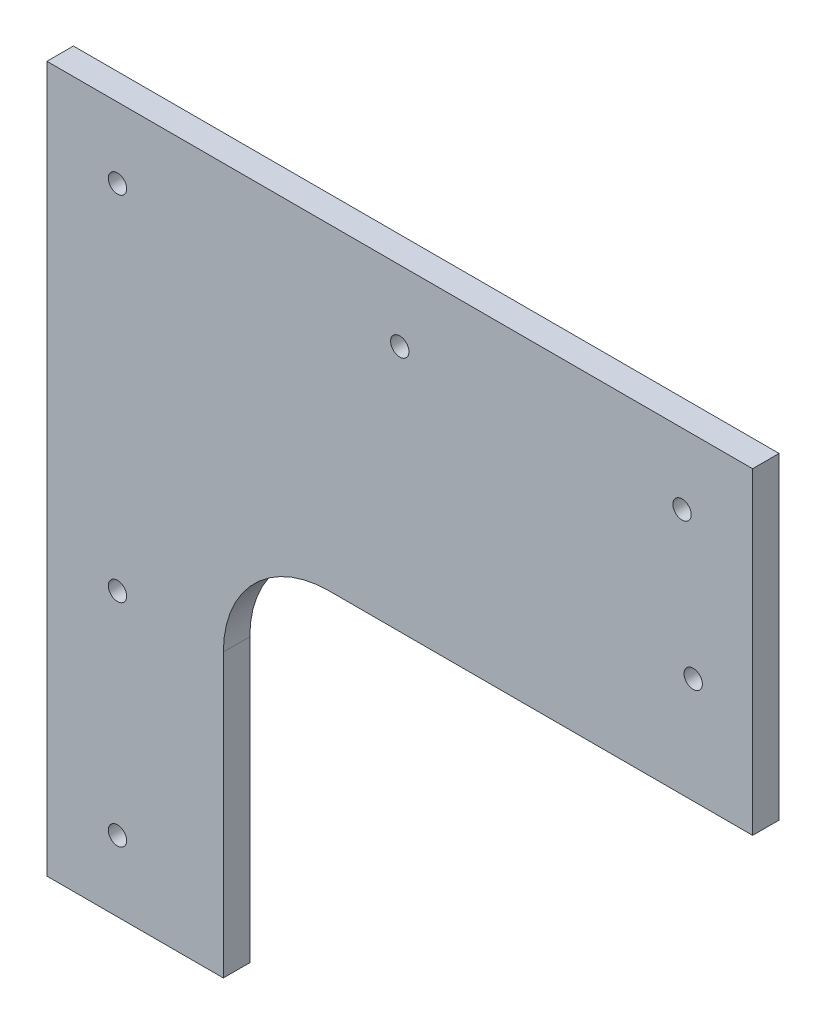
ISO-10303-21;
HEADER;
FILE_DESCRIPTION(('STEP AP214'),'2;1');
FILE_NAME('part.step','',(''),(''),'','','');
FILE_SCHEMA(('AUTOMOTIVE_DESIGN { 1 0 10303 214 1 1 1 1 }'));
ENDSEC;
DATA;
#1=APPLICATION_CONTEXT('core data for automotive mechanical design processes');
#2=APPLICATION_PROTOCOL_DEFINITION('international standard','automotive_design',2000,#1);
#3=PRODUCT_CONTEXT('',#1,'mechanical');
#4=PRODUCT('Part','Part','',(#3));
#5=PRODUCT_RELATED_PRODUCT_CATEGORY('part','',(#4));
#6=PRODUCT_DEFINITION_FORMATION('','',#4);
#7=PRODUCT_DEFINITION_CONTEXT('part definition',#1,'design');
#8=PRODUCT_DEFINITION('design','',#6,#7);
#9=PRODUCT_DEFINITION_SHAPE('','',#8);
#10=(LENGTH_UNIT() NAMED_UNIT(*) SI_UNIT(.MILLI.,.METRE.));
#11=(NAMED_UNIT(*) PLANE_ANGLE_UNIT() SI_UNIT($,.RADIAN.));
#12=(NAMED_UNIT(*) SI_UNIT($,.STERADIAN.) SOLID_ANGLE_UNIT());
#13=UNCERTAINTY_MEASURE_WITH_UNIT(LENGTH_MEASURE(1.E-05),#10,'distance_accuracy_value','');
#14=(GEOMETRIC_REPRESENTATION_CONTEXT(3) GLOBAL_UNCERTAINTY_ASSIGNED_CONTEXT((#13)) GLOBAL_UNIT_ASSIGNED_CONTEXT((#10,
#11,#12)) REPRESENTATION_CONTEXT('',''));
#15=CARTESIAN_POINT('',(0.,0.,0.));
#16=DIRECTION('',(0.,0.,1.));
#17=DIRECTION('',(1.,0.,0.));
#18=AXIS2_PLACEMENT_3D('',#15,#16,#17);
#19=CARTESIAN_POINT('',(0.,-254.,9.525));
#20=DIRECTION('',(1.,0.,0.));
#21=DIRECTION('',(0.,0.,-1.));
#22=AXIS2_PLACEMENT_3D('',#19,#20,#21);
#23=PLANE('',#22);
#24=DIRECTION('',(0.,-1.,0.));
#25=VECTOR('',#24,1.);
#26=CARTESIAN_POINT('',(0.,-254.,0.));
#27=LINE('',#26,#25);
#28=CARTESIAN_POINT('',(0.,0.,0.));
#29=VERTEX_POINT('',#28);
#30=CARTESIAN_POINT('',(0.,-254.,0.));
#31=VERTEX_POINT('',#30);
#32=EDGE_CURVE('E111',#29,#31,#27,.T.);
#33=ORIENTED_EDGE('',*,*,#32,.T.);
#34=DIRECTION('',(0.,0.,-1.));
#35=VECTOR('',#34,1.);
#36=CARTESIAN_POINT('',(0.,-254.,9.525));
#37=LINE('',#36,#35);
#38=CARTESIAN_POINT('',(0.,-254.,9.525));
#39=VERTEX_POINT('',#38);
#40=EDGE_CURVE('E93',#39,#31,#37,.T.);
#41=ORIENTED_EDGE('',*,*,#40,.F.);
#42=DIRECTION('',(0.,-1.,0.));
#43=VECTOR('',#42,1.);
#44=CARTESIAN_POINT('',(0.,-254.,9.525));
#45=LINE('',#44,#43);
#46=CARTESIAN_POINT('',(0.,0.,9.525));
#47=VERTEX_POINT('',#46);
#48=EDGE_CURVE('E99',#47,#39,#45,.T.);
#49=ORIENTED_EDGE('',*,*,#48,.F.);
#50=DIRECTION('',(0.,0.,-1.));
#51=VECTOR('',#50,1.);
#52=CARTESIAN_POINT('',(0.,0.,9.525));
#53=LINE('',#52,#51);
#54=EDGE_CURVE('E125',#47,#29,#53,.T.);
#55=ORIENTED_EDGE('',*,*,#54,.T.);
#56=EDGE_LOOP('',(#33,#41,#49,#55));
#57=FACE_BOUND('',#56,.T.);
#58=ADVANCED_FACE('F30',(#57),#23,.F.);
#59=CARTESIAN_POINT('',(63.5,-254.,9.525));
#60=DIRECTION('',(0.,1.,0.));
#61=DIRECTION('',(0.,0.,1.));
#62=AXIS2_PLACEMENT_3D('',#59,#60,#61);
#63=PLANE('',#62);
#64=DIRECTION('',(1.,0.,0.));
#65=VECTOR('',#64,1.);
#66=CARTESIAN_POINT('',(63.5,-254.,0.));
#67=LINE('',#66,#65);
#68=CARTESIAN_POINT('',(63.5,-254.,0.));
#69=VERTEX_POINT('',#68);
#70=EDGE_CURVE('E134',#31,#69,#67,.T.);
#71=ORIENTED_EDGE('',*,*,#70,.T.);
#72=DIRECTION('',(0.,0.,-1.));
#73=VECTOR('',#72,1.);
#74=CARTESIAN_POINT('',(63.5,-254.,9.525));
#75=LINE('',#74,#73);
#76=CARTESIAN_POINT('',(63.5,-254.,9.525));
#77=VERTEX_POINT('',#76);
#78=EDGE_CURVE('E96',#77,#69,#75,.T.);
#79=ORIENTED_EDGE('',*,*,#78,.F.);
#80=DIRECTION('',(1.,0.,0.));
#81=VECTOR('',#80,1.);
#82=CARTESIAN_POINT('',(63.5,-254.,9.525));
#83=LINE('',#82,#81);
#84=EDGE_CURVE('E89',#39,#77,#83,.T.);
#85=ORIENTED_EDGE('',*,*,#84,.F.);
#86=ORIENTED_EDGE('',*,*,#40,.T.);
#87=EDGE_LOOP('',(#71,#79,#85,#86));
#88=FACE_BOUND('',#87,.T.);
#89=ADVANCED_FACE('F91',(#88),#63,.F.);
#90=CARTESIAN_POINT('',(63.5,-114.3,9.525));
#91=DIRECTION('',(-1.,0.,0.));
#92=DIRECTION('',(0.,0.,1.));
#93=AXIS2_PLACEMENT_3D('',#90,#91,#92);
#94=PLANE('',#93);
#95=DIRECTION('',(0.,1.,0.));
#96=VECTOR('',#95,1.);
#97=CARTESIAN_POINT('',(63.5,-114.3,0.));
#98=LINE('',#97,#96);
#99=CARTESIAN_POINT('',(63.5,-152.4,0.));
#100=VERTEX_POINT('',#99);
#101=EDGE_CURVE('E132',#69,#100,#98,.T.);
#102=ORIENTED_EDGE('',*,*,#101,.T.);
#103=DIRECTION('',(0.,0.,-1.));
#104=VECTOR('',#103,1.);
#105=CARTESIAN_POINT('',(63.5,-152.4,9.525));
#106=LINE('',#105,#104);
#107=CARTESIAN_POINT('',(63.5,-152.4,9.525));
#108=VERTEX_POINT('',#107);
#109=EDGE_CURVE('E45',#100,#108,#106,.F.);
#110=ORIENTED_EDGE('',*,*,#109,.T.);
#111=DIRECTION('',(0.,1.,0.));
#112=VECTOR('',#111,1.);
#113=CARTESIAN_POINT('',(63.5,-114.3,9.525));
#114=LINE('',#113,#112);
#115=EDGE_CURVE('E98',#77,#108,#114,.T.);
#116=ORIENTED_EDGE('',*,*,#115,.F.);
#117=ORIENTED_EDGE('',*,*,#78,.T.);
#118=EDGE_LOOP('',(#102,#110,#116,#117));
#119=FACE_BOUND('',#118,.T.);
#120=ADVANCED_FACE('F222',(#119),#94,.F.);
#121=CARTESIAN_POINT('',(254.,-114.3,9.525));
#122=DIRECTION('',(0.,1.,0.));
#123=DIRECTION('',(-1.,0.,0.));
#124=AXIS2_PLACEMENT_3D('',#121,#122,#123);
#125=PLANE('',#124);
#126=DIRECTION('',(1.,0.,0.));
#127=VECTOR('',#126,1.);
#128=CARTESIAN_POINT('',(254.,-114.3,9.525));
#129=LINE('',#128,#127);
#130=CARTESIAN_POINT('',(101.6,-114.3,9.525));
#131=VERTEX_POINT('',#130);
#132=CARTESIAN_POINT('',(254.,-114.3,9.525));
#133=VERTEX_POINT('',#132);
#134=EDGE_CURVE('E141',#131,#133,#129,.T.);
#135=ORIENTED_EDGE('',*,*,#134,.F.);
#136=DIRECTION('',(0.,0.,-1.));
#137=VECTOR('',#136,1.);
#138=CARTESIAN_POINT('',(101.6,-114.3,0.));
#139=LINE('',#138,#137);
#140=CARTESIAN_POINT('',(101.6,-114.3,0.));
#141=VERTEX_POINT('',#140);
#142=EDGE_CURVE('E112',#131,#141,#139,.T.);
#143=ORIENTED_EDGE('',*,*,#142,.T.);
#144=DIRECTION('',(1.,0.,0.));
#145=VECTOR('',#144,1.);
#146=CARTESIAN_POINT('',(254.,-114.3,0.));
#147=LINE('',#146,#145);
#148=CARTESIAN_POINT('',(254.,-114.3,0.));
#149=VERTEX_POINT('',#148);
#150=EDGE_CURVE('E130',#141,#149,#147,.T.);
#151=ORIENTED_EDGE('',*,*,#150,.T.);
#152=DIRECTION('',(0.,0.,-1.));
#153=VECTOR('',#152,1.);
#154=CARTESIAN_POINT('',(254.,-114.3,9.525));
#155=LINE('',#154,#153);
#156=EDGE_CURVE('E116',#133,#149,#155,.T.);
#157=ORIENTED_EDGE('',*,*,#156,.F.);
#158=EDGE_LOOP('',(#135,#143,#151,#157));
#159=FACE_BOUND('',#158,.T.);
#160=ADVANCED_FACE('F227',(#159),#125,.F.);
#161=CARTESIAN_POINT('',(254.,0.,9.525));
#162=DIRECTION('',(-1.,0.,0.));
#163=DIRECTION('',(0.,0.,1.));
#164=AXIS2_PLACEMENT_3D('',#161,#162,#163);
#165=PLANE('',#164);
#166=DIRECTION('',(0.,1.,0.));
#167=VECTOR('',#166,1.);
#168=CARTESIAN_POINT('',(254.,0.,0.));
#169=LINE('',#168,#167);
#170=CARTESIAN_POINT('',(254.,0.,0.));
#171=VERTEX_POINT('',#170);
#172=EDGE_CURVE('E128',#149,#171,#169,.T.);
#173=ORIENTED_EDGE('',*,*,#172,.T.);
#174=DIRECTION('',(0.,0.,-1.));
#175=VECTOR('',#174,1.);
#176=CARTESIAN_POINT('',(254.,0.,9.525));
#177=LINE('',#176,#175);
#178=CARTESIAN_POINT('',(254.,0.,9.525));
#179=VERTEX_POINT('',#178);
#180=EDGE_CURVE('E122',#179,#171,#177,.T.);
#181=ORIENTED_EDGE('',*,*,#180,.F.);
#182=DIRECTION('',(0.,1.,0.));
#183=VECTOR('',#182,1.);
#184=CARTESIAN_POINT('',(254.,0.,9.525));
#185=LINE('',#184,#183);
#186=EDGE_CURVE('E139',#133,#179,#185,.T.);
#187=ORIENTED_EDGE('',*,*,#186,.F.);
#188=ORIENTED_EDGE('',*,*,#156,.T.);
#189=EDGE_LOOP('',(#173,#181,#187,#188));
#190=FACE_BOUND('',#189,.T.);
#191=ADVANCED_FACE('F230',(#190),#165,.F.);
#192=CARTESIAN_POINT('',(0.,0.,9.525));
#193=DIRECTION('',(0.,-1.,0.));
#194=DIRECTION('',(0.,0.,-1.));
#195=AXIS2_PLACEMENT_3D('',#192,#193,#194);
#196=PLANE('',#195);
#197=DIRECTION('',(-1.,0.,0.));
#198=VECTOR('',#197,1.);
#199=CARTESIAN_POINT('',(0.,0.,0.));
#200=LINE('',#199,#198);
#201=EDGE_CURVE('E108',#171,#29,#200,.T.);
#202=ORIENTED_EDGE('',*,*,#201,.T.);
#203=ORIENTED_EDGE('',*,*,#54,.F.);
#204=DIRECTION('',(-1.,0.,0.));
#205=VECTOR('',#204,1.);
#206=CARTESIAN_POINT('',(0.,0.,9.525));
#207=LINE('',#206,#205);
#208=EDGE_CURVE('E104',#179,#47,#207,.T.);
#209=ORIENTED_EDGE('',*,*,#208,.F.);
#210=ORIENTED_EDGE('',*,*,#180,.T.);
#211=EDGE_LOOP('',(#202,#203,#209,#210));
#212=FACE_BOUND('',#211,.T.);
#213=ADVANCED_FACE('F192',(#212),#196,.F.);
#214=CARTESIAN_POINT('',(0.,0.,9.525));
#215=DIRECTION('',(0.,0.,-1.));
#216=DIRECTION('',(-1.,0.,0.));
#217=AXIS2_PLACEMENT_3D('',#214,#215,#216);
#218=PLANE('',#217);
#219=CARTESIAN_POINT('',(232.613237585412,-76.2,9.525));
#220=DIRECTION('',(0.,0.,1.));
#221=DIRECTION('',(1.,0.,0.));
#222=AXIS2_PLACEMENT_3D('',#219,#220,#221);
#223=CIRCLE('',#222,3.30200000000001);
#224=CARTESIAN_POINT('',(235.915237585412,-76.2,9.525));
#225=VERTEX_POINT('',#224);
#226=EDGE_CURVE('E174',#225,#225,#223,.T.);
#227=ORIENTED_EDGE('',*,*,#226,.F.);
#228=EDGE_LOOP('',(#227));
#229=FACE_BOUND('',#228,.T.);
#230=CARTESIAN_POINT('',(228.6,-25.4,9.525));
#231=DIRECTION('',(0.,0.,1.));
#232=DIRECTION('',(1.,0.,0.));
#233=AXIS2_PLACEMENT_3D('',#230,#231,#232);
#234=CIRCLE('',#233,3.30200000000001);
#235=CARTESIAN_POINT('',(231.902,-25.4,9.525));
#236=VERTEX_POINT('',#235);
#237=EDGE_CURVE('E168',#236,#236,#234,.T.);
#238=ORIENTED_EDGE('',*,*,#237,.F.);
#239=EDGE_LOOP('',(#238));
#240=FACE_BOUND('',#239,.T.);
#241=CARTESIAN_POINT('',(127.,-25.4,9.525));
#242=DIRECTION('',(0.,0.,1.));
#243=DIRECTION('',(1.,0.,0.));
#244=AXIS2_PLACEMENT_3D('',#241,#242,#243);
#245=CIRCLE('',#244,3.30200000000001);
#246=CARTESIAN_POINT('',(130.302,-25.4,9.525));
#247=VERTEX_POINT('',#246);
#248=EDGE_CURVE('E162',#247,#247,#245,.T.);
#249=ORIENTED_EDGE('',*,*,#248,.F.);
#250=EDGE_LOOP('',(#249));
#251=FACE_BOUND('',#250,.T.);
#252=CARTESIAN_POINT('',(25.4,-25.4,9.525));
#253=DIRECTION('',(0.,0.,1.));
#254=DIRECTION('',(1.,0.,0.));
#255=AXIS2_PLACEMENT_3D('',#252,#253,#254);
#256=CIRCLE('',#255,3.302);
#257=CARTESIAN_POINT('',(28.702,-25.4,9.525));
#258=VERTEX_POINT('',#257);
#259=EDGE_CURVE('E156',#258,#258,#256,.T.);
#260=ORIENTED_EDGE('',*,*,#259,.F.);
#261=EDGE_LOOP('',(#260));
#262=FACE_BOUND('',#261,.T.);
#263=CARTESIAN_POINT('',(25.4,-152.4,9.525));
#264=DIRECTION('',(0.,0.,1.));
#265=DIRECTION('',(1.,0.,0.));
#266=AXIS2_PLACEMENT_3D('',#263,#264,#265);
#267=CIRCLE('',#266,3.30199999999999);
#268=CARTESIAN_POINT('',(28.702,-152.4,9.525));
#269=VERTEX_POINT('',#268);
#270=EDGE_CURVE('E150',#269,#269,#267,.T.);
#271=ORIENTED_EDGE('',*,*,#270,.F.);
#272=EDGE_LOOP('',(#271));
#273=FACE_BOUND('',#272,.T.);
#274=CARTESIAN_POINT('',(25.4,-228.6,9.525));
#275=DIRECTION('',(0.,0.,1.));
#276=DIRECTION('',(1.,0.,0.));
#277=AXIS2_PLACEMENT_3D('',#274,#275,#276);
#278=CIRCLE('',#277,3.30199999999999);
#279=CARTESIAN_POINT('',(28.702,-228.6,9.525));
#280=VERTEX_POINT('',#279);
#281=EDGE_CURVE('E144',#280,#280,#278,.T.);
#282=ORIENTED_EDGE('',*,*,#281,.F.);
#283=EDGE_LOOP('',(#282));
#284=FACE_BOUND('',#283,.T.);
#285=ORIENTED_EDGE('',*,*,#48,.T.);
#286=ORIENTED_EDGE('',*,*,#84,.T.);
#287=ORIENTED_EDGE('',*,*,#115,.T.);
#288=CARTESIAN_POINT('',(101.6,-152.4,9.525));
#289=DIRECTION('',(0.,0.,-1.));
#290=DIRECTION('',(-1.,0.,0.));
#291=AXIS2_PLACEMENT_3D('',#288,#289,#290);
#292=CIRCLE('',#291,38.1);
#293=EDGE_CURVE('E11',#108,#131,#292,.T.);
#294=ORIENTED_EDGE('',*,*,#293,.T.);
#295=ORIENTED_EDGE('',*,*,#134,.T.);
#296=ORIENTED_EDGE('',*,*,#186,.T.);
#297=ORIENTED_EDGE('',*,*,#208,.T.);
#298=EDGE_LOOP('',(#285,#286,#287,#294,#295,#296,#297));
#299=FACE_BOUND('',#298,.T.);
#300=ADVANCED_FACE('F102',(#229,#240,#251,#262,#273,#284,#299),#218,.F.);
#301=CARTESIAN_POINT('',(0.,0.,0.));
#302=DIRECTION('',(0.,0.,-1.));
#303=DIRECTION('',(-1.,0.,0.));
#304=AXIS2_PLACEMENT_3D('',#301,#302,#303);
#305=PLANE('',#304);
#306=CARTESIAN_POINT('',(232.613237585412,-76.2,0.));
#307=DIRECTION('',(0.,0.,1.));
#308=DIRECTION('',(1.,0.,0.));
#309=AXIS2_PLACEMENT_3D('',#306,#307,#308);
#310=CIRCLE('',#309,3.30200000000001);
#311=CARTESIAN_POINT('',(235.915237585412,-76.2,0.));
#312=VERTEX_POINT('',#311);
#313=EDGE_CURVE('E171',#312,#312,#310,.T.);
#314=ORIENTED_EDGE('',*,*,#313,.T.);
#315=EDGE_LOOP('',(#314));
#316=FACE_BOUND('',#315,.T.);
#317=CARTESIAN_POINT('',(228.6,-25.4,0.));
#318=DIRECTION('',(0.,0.,1.));
#319=DIRECTION('',(1.,0.,0.));
#320=AXIS2_PLACEMENT_3D('',#317,#318,#319);
#321=CIRCLE('',#320,3.30200000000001);
#322=CARTESIAN_POINT('',(231.902,-25.4,0.));
#323=VERTEX_POINT('',#322);
#324=EDGE_CURVE('E165',#323,#323,#321,.T.);
#325=ORIENTED_EDGE('',*,*,#324,.T.);
#326=EDGE_LOOP('',(#325));
#327=FACE_BOUND('',#326,.T.);
#328=CARTESIAN_POINT('',(127.,-25.4,0.));
#329=DIRECTION('',(0.,0.,1.));
#330=DIRECTION('',(1.,0.,0.));
#331=AXIS2_PLACEMENT_3D('',#328,#329,#330);
#332=CIRCLE('',#331,3.30200000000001);
#333=CARTESIAN_POINT('',(130.302,-25.4,0.));
#334=VERTEX_POINT('',#333);
#335=EDGE_CURVE('E159',#334,#334,#332,.T.);
#336=ORIENTED_EDGE('',*,*,#335,.T.);
#337=EDGE_LOOP('',(#336));
#338=FACE_BOUND('',#337,.T.);
#339=CARTESIAN_POINT('',(25.4,-25.4,0.));
#340=DIRECTION('',(0.,0.,1.));
#341=DIRECTION('',(1.,0.,0.));
#342=AXIS2_PLACEMENT_3D('',#339,#340,#341);
#343=CIRCLE('',#342,3.302);
#344=CARTESIAN_POINT('',(28.702,-25.4,0.));
#345=VERTEX_POINT('',#344);
#346=EDGE_CURVE('E153',#345,#345,#343,.T.);
#347=ORIENTED_EDGE('',*,*,#346,.T.);
#348=EDGE_LOOP('',(#347));
#349=FACE_BOUND('',#348,.T.);
#350=CARTESIAN_POINT('',(25.4,-152.4,0.));
#351=DIRECTION('',(0.,0.,1.));
#352=DIRECTION('',(1.,0.,0.));
#353=AXIS2_PLACEMENT_3D('',#350,#351,#352);
#354=CIRCLE('',#353,3.30199999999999);
#355=CARTESIAN_POINT('',(28.702,-152.4,0.));
#356=VERTEX_POINT('',#355);
#357=EDGE_CURVE('E147',#356,#356,#354,.T.);
#358=ORIENTED_EDGE('',*,*,#357,.T.);
#359=EDGE_LOOP('',(#358));
#360=FACE_BOUND('',#359,.T.);
#361=CARTESIAN_POINT('',(25.4,-228.6,0.));
#362=DIRECTION('',(0.,0.,1.));
#363=DIRECTION('',(1.,0.,0.));
#364=AXIS2_PLACEMENT_3D('',#361,#362,#363);
#365=CIRCLE('',#364,3.30199999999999);
#366=CARTESIAN_POINT('',(28.702,-228.6,0.));
#367=VERTEX_POINT('',#366);
#368=EDGE_CURVE('E137',#367,#367,#365,.T.);
#369=ORIENTED_EDGE('',*,*,#368,.T.);
#370=EDGE_LOOP('',(#369));
#371=FACE_BOUND('',#370,.T.);
#372=ORIENTED_EDGE('',*,*,#32,.F.);
#373=ORIENTED_EDGE('',*,*,#201,.F.);
#374=ORIENTED_EDGE('',*,*,#172,.F.);
#375=ORIENTED_EDGE('',*,*,#150,.F.);
#376=CARTESIAN_POINT('',(101.6,-152.4,0.));
#377=DIRECTION('',(0.,0.,-1.));
#378=DIRECTION('',(-1.,0.,0.));
#379=AXIS2_PLACEMENT_3D('',#376,#377,#378);
#380=CIRCLE('',#379,38.1);
#381=EDGE_CURVE('E38',#141,#100,#380,.F.);
#382=ORIENTED_EDGE('',*,*,#381,.T.);
#383=ORIENTED_EDGE('',*,*,#101,.F.);
#384=ORIENTED_EDGE('',*,*,#70,.F.);
#385=EDGE_LOOP('',(#372,#373,#374,#375,#382,#383,#384));
#386=FACE_BOUND('',#385,.T.);
#387=ADVANCED_FACE('F180',(#316,#327,#338,#349,#360,#371,#386),#305,.T.);
#388=CARTESIAN_POINT('',(101.6,-152.4,9.525));
#389=DIRECTION('',(0.,0.,1.));
#390=DIRECTION('',(1.,0.,0.));
#391=AXIS2_PLACEMENT_3D('',#388,#389,#390);
#392=CYLINDRICAL_SURFACE('',#391,38.1);
#393=ORIENTED_EDGE('',*,*,#293,.F.);
#394=ORIENTED_EDGE('',*,*,#109,.F.);
#395=ORIENTED_EDGE('',*,*,#381,.F.);
#396=ORIENTED_EDGE('',*,*,#142,.F.);
#397=EDGE_LOOP('',(#393,#394,#395,#396));
#398=FACE_BOUND('',#397,.T.);
#399=ADVANCED_FACE('F32',(#398),#392,.F.);
#400=CARTESIAN_POINT('',(25.4,-228.6,0.));
#401=DIRECTION('',(0.,0.,1.));
#402=DIRECTION('',(1.,0.,0.));
#403=AXIS2_PLACEMENT_3D('',#400,#401,#402);
#404=CYLINDRICAL_SURFACE('',#403,3.30199999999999);
#405=CARTESIAN_POINT('',(28.702,-228.6,0.));
#406=CARTESIAN_POINT('',(28.702,-228.6,0.0992187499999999));
#407=CARTESIAN_POINT('',(28.702,-228.6,0.1984375));
#408=CARTESIAN_POINT('',(28.702,-228.6,0.396875));
#409=CARTESIAN_POINT('',(28.702,-228.6,0.49609375));
#410=CARTESIAN_POINT('',(28.702,-228.6,0.69453125));
#411=CARTESIAN_POINT('',(28.702,-228.6,0.79375));
#412=CARTESIAN_POINT('',(28.702,-228.6,0.9921875));
#413=CARTESIAN_POINT('',(28.702,-228.6,1.09140625));
#414=CARTESIAN_POINT('',(28.702,-228.6,1.28984375));
#415=CARTESIAN_POINT('',(28.702,-228.6,1.3890625));
#416=CARTESIAN_POINT('',(28.702,-228.6,1.5875));
#417=CARTESIAN_POINT('',(28.702,-228.6,1.68671875));
#418=CARTESIAN_POINT('',(28.702,-228.6,1.88515625));
#419=CARTESIAN_POINT('',(28.702,-228.6,1.984375));
#420=CARTESIAN_POINT('',(28.702,-228.6,2.1828125));
#421=CARTESIAN_POINT('',(28.702,-228.6,2.28203125));
#422=CARTESIAN_POINT('',(28.702,-228.6,2.48046875));
#423=CARTESIAN_POINT('',(28.702,-228.6,2.5796875));
#424=CARTESIAN_POINT('',(28.702,-228.6,2.778125));
#425=CARTESIAN_POINT('',(28.702,-228.6,2.87734375));
#426=CARTESIAN_POINT('',(28.702,-228.6,3.07578125));
#427=CARTESIAN_POINT('',(28.702,-228.6,3.175));
#428=CARTESIAN_POINT('',(28.702,-228.6,3.3734375));
#429=CARTESIAN_POINT('',(28.702,-228.6,3.47265625));
#430=CARTESIAN_POINT('',(28.702,-228.6,3.67109375));
#431=CARTESIAN_POINT('',(28.702,-228.6,3.7703125));
#432=CARTESIAN_POINT('',(28.702,-228.6,3.96875));
#433=CARTESIAN_POINT('',(28.702,-228.6,4.06796875));
#434=CARTESIAN_POINT('',(28.702,-228.6,4.26640625));
#435=CARTESIAN_POINT('',(28.702,-228.6,4.365625));
#436=CARTESIAN_POINT('',(28.702,-228.6,4.5640625));
#437=CARTESIAN_POINT('',(28.702,-228.6,4.66328125));
#438=CARTESIAN_POINT('',(28.702,-228.6,4.86171875));
#439=CARTESIAN_POINT('',(28.702,-228.6,4.9609375));
#440=CARTESIAN_POINT('',(28.702,-228.6,5.159375));
#441=CARTESIAN_POINT('',(28.702,-228.6,5.25859375));
#442=CARTESIAN_POINT('',(28.702,-228.6,5.45703125));
#443=CARTESIAN_POINT('',(28.702,-228.6,5.55625));
#444=CARTESIAN_POINT('',(28.702,-228.6,5.7546875));
#445=CARTESIAN_POINT('',(28.702,-228.6,5.85390625));
#446=CARTESIAN_POINT('',(28.702,-228.6,6.05234375));
#447=CARTESIAN_POINT('',(28.702,-228.6,6.1515625));
#448=CARTESIAN_POINT('',(28.702,-228.6,6.35));
#449=CARTESIAN_POINT('',(28.702,-228.6,6.44921875));
#450=CARTESIAN_POINT('',(28.702,-228.6,6.64765625));
#451=CARTESIAN_POINT('',(28.702,-228.6,6.746875));
#452=CARTESIAN_POINT('',(28.702,-228.6,6.9453125));
#453=CARTESIAN_POINT('',(28.702,-228.6,7.04453125));
#454=CARTESIAN_POINT('',(28.702,-228.6,7.24296875));
#455=CARTESIAN_POINT('',(28.702,-228.6,7.3421875));
#456=CARTESIAN_POINT('',(28.702,-228.6,7.540625));
#457=CARTESIAN_POINT('',(28.702,-228.6,7.63984375));
#458=CARTESIAN_POINT('',(28.702,-228.6,7.83828125));
#459=CARTESIAN_POINT('',(28.702,-228.6,7.9375));
#460=CARTESIAN_POINT('',(28.702,-228.6,8.1359375));
#461=CARTESIAN_POINT('',(28.702,-228.6,8.23515625));
#462=CARTESIAN_POINT('',(28.702,-228.6,8.43359375));
#463=CARTESIAN_POINT('',(28.702,-228.6,8.5328125));
#464=CARTESIAN_POINT('',(28.702,-228.6,8.73125));
#465=CARTESIAN_POINT('',(28.702,-228.6,8.83046875));
#466=CARTESIAN_POINT('',(28.702,-228.6,9.02890625));
#467=CARTESIAN_POINT('',(28.702,-228.6,9.128125));
#468=CARTESIAN_POINT('',(28.702,-228.6,9.3265625));
#469=CARTESIAN_POINT('',(28.702,-228.6,9.42578125));
#470=CARTESIAN_POINT('',(28.702,-228.6,9.525));
#471=B_SPLINE_CURVE_WITH_KNOTS('',3,(#405,#406,#407,#408,#409,#410,#411,#412,#413,#414,#415,
#416,#417,#418,#419,#420,#421,#422,#423,#424,#425,#426,#427,#428,#429,#430,#431,#432,#433,#434,
#435,#436,#437,#438,#439,#440,#441,#442,#443,#444,#445,#446,#447,#448,#449,#450,#451,#452,#453,
#454,#455,#456,#457,#458,#459,#460,#461,#462,#463,#464,#465,#466,#467,#468,#469,#470),
.UNSPECIFIED.,.F.,.F.,(4,2,2,2,2,2,2,2,2,2,2,2,2,2,2,2,2,2,2,2,2,2,2,2,2,2,2,2,2,2,2,2,4),(0.,
0.29765625,0.5953125,0.89296875,1.190625,1.48828125,1.7859375,2.08359375,2.38125,2.67890625,
2.9765625,3.27421875,3.571875,3.86953125,4.1671875,4.46484375,4.7625,5.06015625,5.3578125,
5.65546875,5.953125,6.25078125,6.5484375,6.84609375,7.14375,7.44140625,7.7390625,8.03671875,
8.334375,8.63203125,8.9296875,9.22734375,9.525),.UNSPECIFIED.);
#472=EDGE_CURVE('BSEAM204',#367,#280,#471,.T.);
#473=ORIENTED_EDGE('',*,*,#368,.F.);
#474=ORIENTED_EDGE('',*,*,#281,.T.);
#475=ORIENTED_EDGE('',*,*,#472,.T.);
#476=ORIENTED_EDGE('',*,*,#472,.F.);
#477=EDGE_LOOP('',(#473,#475,#474,#476));
#478=FACE_BOUND('',#477,.T.);
#479=ADVANCED_FACE('F204',(#478),#404,.F.);
#480=CARTESIAN_POINT('',(25.4,-152.4,0.));
#481=DIRECTION('',(0.,0.,1.));
#482=DIRECTION('',(1.,0.,0.));
#483=AXIS2_PLACEMENT_3D('',#480,#481,#482);
#484=CYLINDRICAL_SURFACE('',#483,3.30199999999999);
#485=CARTESIAN_POINT('',(28.702,-152.4,0.));
#486=CARTESIAN_POINT('',(28.702,-152.4,0.0992187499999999));
#487=CARTESIAN_POINT('',(28.702,-152.4,0.1984375));
#488=CARTESIAN_POINT('',(28.702,-152.4,0.396875));
#489=CARTESIAN_POINT('',(28.702,-152.4,0.49609375));
#490=CARTESIAN_POINT('',(28.702,-152.4,0.69453125));
#491=CARTESIAN_POINT('',(28.702,-152.4,0.79375));
#492=CARTESIAN_POINT('',(28.702,-152.4,0.9921875));
#493=CARTESIAN_POINT('',(28.702,-152.4,1.09140625));
#494=CARTESIAN_POINT('',(28.702,-152.4,1.28984375));
#495=CARTESIAN_POINT('',(28.702,-152.4,1.3890625));
#496=CARTESIAN_POINT('',(28.702,-152.4,1.5875));
#497=CARTESIAN_POINT('',(28.702,-152.4,1.68671875));
#498=CARTESIAN_POINT('',(28.702,-152.4,1.88515625));
#499=CARTESIAN_POINT('',(28.702,-152.4,1.984375));
#500=CARTESIAN_POINT('',(28.702,-152.4,2.1828125));
#501=CARTESIAN_POINT('',(28.702,-152.4,2.28203125));
#502=CARTESIAN_POINT('',(28.702,-152.4,2.48046875));
#503=CARTESIAN_POINT('',(28.702,-152.4,2.5796875));
#504=CARTESIAN_POINT('',(28.702,-152.4,2.778125));
#505=CARTESIAN_POINT('',(28.702,-152.4,2.87734375));
#506=CARTESIAN_POINT('',(28.702,-152.4,3.07578125));
#507=CARTESIAN_POINT('',(28.702,-152.4,3.175));
#508=CARTESIAN_POINT('',(28.702,-152.4,3.3734375));
#509=CARTESIAN_POINT('',(28.702,-152.4,3.47265625));
#510=CARTESIAN_POINT('',(28.702,-152.4,3.67109375));
#511=CARTESIAN_POINT('',(28.702,-152.4,3.7703125));
#512=CARTESIAN_POINT('',(28.702,-152.4,3.96875));
#513=CARTESIAN_POINT('',(28.702,-152.4,4.06796875));
#514=CARTESIAN_POINT('',(28.702,-152.4,4.26640625));
#515=CARTESIAN_POINT('',(28.702,-152.4,4.365625));
#516=CARTESIAN_POINT('',(28.702,-152.4,4.5640625));
#517=CARTESIAN_POINT('',(28.702,-152.4,4.66328125));
#518=CARTESIAN_POINT('',(28.702,-152.4,4.86171875));
#519=CARTESIAN_POINT('',(28.702,-152.4,4.9609375));
#520=CARTESIAN_POINT('',(28.702,-152.4,5.159375));
#521=CARTESIAN_POINT('',(28.702,-152.4,5.25859375));
#522=CARTESIAN_POINT('',(28.702,-152.4,5.45703125));
#523=CARTESIAN_POINT('',(28.702,-152.4,5.55625));
#524=CARTESIAN_POINT('',(28.702,-152.4,5.7546875));
#525=CARTESIAN_POINT('',(28.702,-152.4,5.85390625));
#526=CARTESIAN_POINT('',(28.702,-152.4,6.05234375));
#527=CARTESIAN_POINT('',(28.702,-152.4,6.1515625));
#528=CARTESIAN_POINT('',(28.702,-152.4,6.35));
#529=CARTESIAN_POINT('',(28.702,-152.4,6.44921875));
#530=CARTESIAN_POINT('',(28.702,-152.4,6.64765625));
#531=CARTESIAN_POINT('',(28.702,-152.4,6.746875));
#532=CARTESIAN_POINT('',(28.702,-152.4,6.9453125));
#533=CARTESIAN_POINT('',(28.702,-152.4,7.04453125));
#534=CARTESIAN_POINT('',(28.702,-152.4,7.24296875));
#535=CARTESIAN_POINT('',(28.702,-152.4,7.3421875));
#536=CARTESIAN_POINT('',(28.702,-152.4,7.540625));
#537=CARTESIAN_POINT('',(28.702,-152.4,7.63984375));
#538=CARTESIAN_POINT('',(28.702,-152.4,7.83828125));
#539=CARTESIAN_POINT('',(28.702,-152.4,7.9375));
#540=CARTESIAN_POINT('',(28.702,-152.4,8.1359375));
#541=CARTESIAN_POINT('',(28.702,-152.4,8.23515625));
#542=CARTESIAN_POINT('',(28.702,-152.4,8.43359375));
#543=CARTESIAN_POINT('',(28.702,-152.4,8.5328125));
#544=CARTESIAN_POINT('',(28.702,-152.4,8.73125));
#545=CARTESIAN_POINT('',(28.702,-152.4,8.83046875));
#546=CARTESIAN_POINT('',(28.702,-152.4,9.02890625));
#547=CARTESIAN_POINT('',(28.702,-152.4,9.128125));
#548=CARTESIAN_POINT('',(28.702,-152.4,9.3265625));
#549=CARTESIAN_POINT('',(28.702,-152.4,9.42578125));
#550=CARTESIAN_POINT('',(28.702,-152.4,9.525));
#551=B_SPLINE_CURVE_WITH_KNOTS('',3,(#485,#486,#487,#488,#489,#490,#491,#492,#493,#494,#495,
#496,#497,#498,#499,#500,#501,#502,#503,#504,#505,#506,#507,#508,#509,#510,#511,#512,#513,#514,
#515,#516,#517,#518,#519,#520,#521,#522,#523,#524,#525,#526,#527,#528,#529,#530,#531,#532,#533,
#534,#535,#536,#537,#538,#539,#540,#541,#542,#543,#544,#545,#546,#547,#548,#549,#550),
.UNSPECIFIED.,.F.,.F.,(4,2,2,2,2,2,2,2,2,2,2,2,2,2,2,2,2,2,2,2,2,2,2,2,2,2,2,2,2,2,2,2,4),(0.,
0.29765625,0.5953125,0.89296875,1.190625,1.48828125,1.7859375,2.08359375,2.38125,2.67890625,
2.9765625,3.27421875,3.571875,3.86953125,4.1671875,4.46484375,4.7625,5.06015625,5.3578125,
5.65546875,5.953125,6.25078125,6.5484375,6.84609375,7.14375,7.44140625,7.7390625,8.03671875,
8.334375,8.63203125,8.9296875,9.22734375,9.525),.UNSPECIFIED.);
#552=EDGE_CURVE('BSEAM206',#356,#269,#551,.T.);
#553=ORIENTED_EDGE('',*,*,#357,.F.);
#554=ORIENTED_EDGE('',*,*,#270,.T.);
#555=ORIENTED_EDGE('',*,*,#552,.T.);
#556=ORIENTED_EDGE('',*,*,#552,.F.);
#557=EDGE_LOOP('',(#553,#555,#554,#556));
#558=FACE_BOUND('',#557,.T.);
#559=ADVANCED_FACE('F206',(#558),#484,.F.);
#560=CARTESIAN_POINT('',(25.4,-25.4,0.));
#561=DIRECTION('',(0.,0.,1.));
#562=DIRECTION('',(1.,0.,0.));
#563=AXIS2_PLACEMENT_3D('',#560,#561,#562);
#564=CYLINDRICAL_SURFACE('',#563,3.302);
#565=CARTESIAN_POINT('',(28.702,-25.4,0.));
#566=CARTESIAN_POINT('',(28.702,-25.4,0.0992187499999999));
#567=CARTESIAN_POINT('',(28.702,-25.4,0.1984375));
#568=CARTESIAN_POINT('',(28.702,-25.4,0.396875));
#569=CARTESIAN_POINT('',(28.702,-25.4,0.49609375));
#570=CARTESIAN_POINT('',(28.702,-25.4,0.69453125));
#571=CARTESIAN_POINT('',(28.702,-25.4,0.79375));
#572=CARTESIAN_POINT('',(28.702,-25.4,0.9921875));
#573=CARTESIAN_POINT('',(28.702,-25.4,1.09140625));
#574=CARTESIAN_POINT('',(28.702,-25.4,1.28984375));
#575=CARTESIAN_POINT('',(28.702,-25.4,1.3890625));
#576=CARTESIAN_POINT('',(28.702,-25.4,1.5875));
#577=CARTESIAN_POINT('',(28.702,-25.4,1.68671875));
#578=CARTESIAN_POINT('',(28.702,-25.4,1.88515625));
#579=CARTESIAN_POINT('',(28.702,-25.4,1.984375));
#580=CARTESIAN_POINT('',(28.702,-25.4,2.1828125));
#581=CARTESIAN_POINT('',(28.702,-25.4,2.28203125));
#582=CARTESIAN_POINT('',(28.702,-25.4,2.48046875));
#583=CARTESIAN_POINT('',(28.702,-25.4,2.5796875));
#584=CARTESIAN_POINT('',(28.702,-25.4,2.778125));
#585=CARTESIAN_POINT('',(28.702,-25.4,2.87734375));
#586=CARTESIAN_POINT('',(28.702,-25.4,3.07578125));
#587=CARTESIAN_POINT('',(28.702,-25.4,3.175));
#588=CARTESIAN_POINT('',(28.702,-25.4,3.3734375));
#589=CARTESIAN_POINT('',(28.702,-25.4,3.47265625));
#590=CARTESIAN_POINT('',(28.702,-25.4,3.67109375));
#591=CARTESIAN_POINT('',(28.702,-25.4,3.7703125));
#592=CARTESIAN_POINT('',(28.702,-25.4,3.96875));
#593=CARTESIAN_POINT('',(28.702,-25.4,4.06796875));
#594=CARTESIAN_POINT('',(28.702,-25.4,4.26640625));
#595=CARTESIAN_POINT('',(28.702,-25.4,4.365625));
#596=CARTESIAN_POINT('',(28.702,-25.4,4.5640625));
#597=CARTESIAN_POINT('',(28.702,-25.4,4.66328125));
#598=CARTESIAN_POINT('',(28.702,-25.4,4.86171875));
#599=CARTESIAN_POINT('',(28.702,-25.4,4.9609375));
#600=CARTESIAN_POINT('',(28.702,-25.4,5.159375));
#601=CARTESIAN_POINT('',(28.702,-25.4,5.25859375));
#602=CARTESIAN_POINT('',(28.702,-25.4,5.45703125));
#603=CARTESIAN_POINT('',(28.702,-25.4,5.55625));
#604=CARTESIAN_POINT('',(28.702,-25.4,5.7546875));
#605=CARTESIAN_POINT('',(28.702,-25.4,5.85390625));
#606=CARTESIAN_POINT('',(28.702,-25.4,6.05234375));
#607=CARTESIAN_POINT('',(28.702,-25.4,6.1515625));
#608=CARTESIAN_POINT('',(28.702,-25.4,6.35));
#609=CARTESIAN_POINT('',(28.702,-25.4,6.44921875));
#610=CARTESIAN_POINT('',(28.702,-25.4,6.64765625));
#611=CARTESIAN_POINT('',(28.702,-25.4,6.746875));
#612=CARTESIAN_POINT('',(28.702,-25.4,6.9453125));
#613=CARTESIAN_POINT('',(28.702,-25.4,7.04453125));
#614=CARTESIAN_POINT('',(28.702,-25.4,7.24296875));
#615=CARTESIAN_POINT('',(28.702,-25.4,7.3421875));
#616=CARTESIAN_POINT('',(28.702,-25.4,7.540625));
#617=CARTESIAN_POINT('',(28.702,-25.4,7.63984375));
#618=CARTESIAN_POINT('',(28.702,-25.4,7.83828125));
#619=CARTESIAN_POINT('',(28.702,-25.4,7.9375));
#620=CARTESIAN_POINT('',(28.702,-25.4,8.1359375));
#621=CARTESIAN_POINT('',(28.702,-25.4,8.23515625));
#622=CARTESIAN_POINT('',(28.702,-25.4,8.43359375));
#623=CARTESIAN_POINT('',(28.702,-25.4,8.5328125));
#624=CARTESIAN_POINT('',(28.702,-25.4,8.73125));
#625=CARTESIAN_POINT('',(28.702,-25.4,8.83046875));
#626=CARTESIAN_POINT('',(28.702,-25.4,9.02890625));
#627=CARTESIAN_POINT('',(28.702,-25.4,9.128125));
#628=CARTESIAN_POINT('',(28.702,-25.4,9.3265625));
#629=CARTESIAN_POINT('',(28.702,-25.4,9.42578125));
#630=CARTESIAN_POINT('',(28.702,-25.4,9.525));
#631=B_SPLINE_CURVE_WITH_KNOTS('',3,(#565,#566,#567,#568,#569,#570,#571,#572,#573,#574,#575,
#576,#577,#578,#579,#580,#581,#582,#583,#584,#585,#586,#587,#588,#589,#590,#591,#592,#593,#594,
#595,#596,#597,#598,#599,#600,#601,#602,#603,#604,#605,#606,#607,#608,#609,#610,#611,#612,#613,
#614,#615,#616,#617,#618,#619,#620,#621,#622,#623,#624,#625,#626,#627,#628,#629,#630),
.UNSPECIFIED.,.F.,.F.,(4,2,2,2,2,2,2,2,2,2,2,2,2,2,2,2,2,2,2,2,2,2,2,2,2,2,2,2,2,2,2,2,4),(0.,
0.29765625,0.5953125,0.89296875,1.190625,1.48828125,1.7859375,2.08359375,2.38125,2.67890625,
2.9765625,3.27421875,3.571875,3.86953125,4.1671875,4.46484375,4.7625,5.06015625,5.3578125,
5.65546875,5.953125,6.25078125,6.5484375,6.84609375,7.14375,7.44140625,7.7390625,8.03671875,
8.334375,8.63203125,8.9296875,9.22734375,9.525),.UNSPECIFIED.);
#632=EDGE_CURVE('BSEAM213',#345,#258,#631,.T.);
#633=ORIENTED_EDGE('',*,*,#346,.F.);
#634=ORIENTED_EDGE('',*,*,#259,.T.);
#635=ORIENTED_EDGE('',*,*,#632,.T.);
#636=ORIENTED_EDGE('',*,*,#632,.F.);
#637=EDGE_LOOP('',(#633,#635,#634,#636));
#638=FACE_BOUND('',#637,.T.);
#639=ADVANCED_FACE('F213',(#638),#564,.F.);
#640=CARTESIAN_POINT('',(127.,-25.4,0.));
#641=DIRECTION('',(0.,0.,1.));
#642=DIRECTION('',(1.,0.,0.));
#643=AXIS2_PLACEMENT_3D('',#640,#641,#642);
#644=CYLINDRICAL_SURFACE('',#643,3.30200000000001);
#645=CARTESIAN_POINT('',(130.302,-25.4,0.));
#646=CARTESIAN_POINT('',(130.302,-25.4,0.0992187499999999));
#647=CARTESIAN_POINT('',(130.302,-25.4,0.1984375));
#648=CARTESIAN_POINT('',(130.302,-25.4,0.396875));
#649=CARTESIAN_POINT('',(130.302,-25.4,0.49609375));
#650=CARTESIAN_POINT('',(130.302,-25.4,0.69453125));
#651=CARTESIAN_POINT('',(130.302,-25.4,0.79375));
#652=CARTESIAN_POINT('',(130.302,-25.4,0.9921875));
#653=CARTESIAN_POINT('',(130.302,-25.4,1.09140625));
#654=CARTESIAN_POINT('',(130.302,-25.4,1.28984375));
#655=CARTESIAN_POINT('',(130.302,-25.4,1.3890625));
#656=CARTESIAN_POINT('',(130.302,-25.4,1.5875));
#657=CARTESIAN_POINT('',(130.302,-25.4,1.68671875));
#658=CARTESIAN_POINT('',(130.302,-25.4,1.88515625));
#659=CARTESIAN_POINT('',(130.302,-25.4,1.984375));
#660=CARTESIAN_POINT('',(130.302,-25.4,2.1828125));
#661=CARTESIAN_POINT('',(130.302,-25.4,2.28203125));
#662=CARTESIAN_POINT('',(130.302,-25.4,2.48046875));
#663=CARTESIAN_POINT('',(130.302,-25.4,2.5796875));
#664=CARTESIAN_POINT('',(130.302,-25.4,2.778125));
#665=CARTESIAN_POINT('',(130.302,-25.4,2.87734375));
#666=CARTESIAN_POINT('',(130.302,-25.4,3.07578125));
#667=CARTESIAN_POINT('',(130.302,-25.4,3.175));
#668=CARTESIAN_POINT('',(130.302,-25.4,3.3734375));
#669=CARTESIAN_POINT('',(130.302,-25.4,3.47265625));
#670=CARTESIAN_POINT('',(130.302,-25.4,3.67109375));
#671=CARTESIAN_POINT('',(130.302,-25.4,3.7703125));
#672=CARTESIAN_POINT('',(130.302,-25.4,3.96875));
#673=CARTESIAN_POINT('',(130.302,-25.4,4.06796875));
#674=CARTESIAN_POINT('',(130.302,-25.4,4.26640625));
#675=CARTESIAN_POINT('',(130.302,-25.4,4.365625));
#676=CARTESIAN_POINT('',(130.302,-25.4,4.5640625));
#677=CARTESIAN_POINT('',(130.302,-25.4,4.66328125));
#678=CARTESIAN_POINT('',(130.302,-25.4,4.86171875));
#679=CARTESIAN_POINT('',(130.302,-25.4,4.9609375));
#680=CARTESIAN_POINT('',(130.302,-25.4,5.159375));
#681=CARTESIAN_POINT('',(130.302,-25.4,5.25859375));
#682=CARTESIAN_POINT('',(130.302,-25.4,5.45703125));
#683=CARTESIAN_POINT('',(130.302,-25.4,5.55625));
#684=CARTESIAN_POINT('',(130.302,-25.4,5.7546875));
#685=CARTESIAN_POINT('',(130.302,-25.4,5.85390625));
#686=CARTESIAN_POINT('',(130.302,-25.4,6.05234375));
#687=CARTESIAN_POINT('',(130.302,-25.4,6.1515625));
#688=CARTESIAN_POINT('',(130.302,-25.4,6.35));
#689=CARTESIAN_POINT('',(130.302,-25.4,6.44921875));
#690=CARTESIAN_POINT('',(130.302,-25.4,6.64765625));
#691=CARTESIAN_POINT('',(130.302,-25.4,6.746875));
#692=CARTESIAN_POINT('',(130.302,-25.4,6.9453125));
#693=CARTESIAN_POINT('',(130.302,-25.4,7.04453125));
#694=CARTESIAN_POINT('',(130.302,-25.4,7.24296875));
#695=CARTESIAN_POINT('',(130.302,-25.4,7.3421875));
#696=CARTESIAN_POINT('',(130.302,-25.4,7.540625));
#697=CARTESIAN_POINT('',(130.302,-25.4,7.63984375));
#698=CARTESIAN_POINT('',(130.302,-25.4,7.83828125));
#699=CARTESIAN_POINT('',(130.302,-25.4,7.9375));
#700=CARTESIAN_POINT('',(130.302,-25.4,8.1359375));
#701=CARTESIAN_POINT('',(130.302,-25.4,8.23515625));
#702=CARTESIAN_POINT('',(130.302,-25.4,8.43359375));
#703=CARTESIAN_POINT('',(130.302,-25.4,8.5328125));
#704=CARTESIAN_POINT('',(130.302,-25.4,8.73125));
#705=CARTESIAN_POINT('',(130.302,-25.4,8.83046875));
#706=CARTESIAN_POINT('',(130.302,-25.4,9.02890625));
#707=CARTESIAN_POINT('',(130.302,-25.4,9.128125));
#708=CARTESIAN_POINT('',(130.302,-25.4,9.3265625));
#709=CARTESIAN_POINT('',(130.302,-25.4,9.42578125));
#710=CARTESIAN_POINT('',(130.302,-25.4,9.525));
#711=B_SPLINE_CURVE_WITH_KNOTS('',3,(#645,#646,#647,#648,#649,#650,#651,#652,#653,#654,#655,
#656,#657,#658,#659,#660,#661,#662,#663,#664,#665,#666,#667,#668,#669,#670,#671,#672,#673,#674,
#675,#676,#677,#678,#679,#680,#681,#682,#683,#684,#685,#686,#687,#688,#689,#690,#691,#692,#693,
#694,#695,#696,#697,#698,#699,#700,#701,#702,#703,#704,#705,#706,#707,#708,#709,#710),
.UNSPECIFIED.,.F.,.F.,(4,2,2,2,2,2,2,2,2,2,2,2,2,2,2,2,2,2,2,2,2,2,2,2,2,2,2,2,2,2,2,2,4),(0.,
0.29765625,0.5953125,0.89296875,1.190625,1.48828125,1.7859375,2.08359375,2.38125,2.67890625,
2.9765625,3.27421875,3.571875,3.86953125,4.1671875,4.46484375,4.7625,5.06015625,5.3578125,
5.65546875,5.953125,6.25078125,6.5484375,6.84609375,7.14375,7.44140625,7.7390625,8.03671875,
8.334375,8.63203125,8.9296875,9.22734375,9.525),.UNSPECIFIED.);
#712=EDGE_CURVE('BSEAM306',#334,#247,#711,.T.);
#713=ORIENTED_EDGE('',*,*,#335,.F.);
#714=ORIENTED_EDGE('',*,*,#248,.T.);
#715=ORIENTED_EDGE('',*,*,#712,.T.);
#716=ORIENTED_EDGE('',*,*,#712,.F.);
#717=EDGE_LOOP('',(#713,#715,#714,#716));
#718=FACE_BOUND('',#717,.T.);
#719=ADVANCED_FACE('F306',(#718),#644,.F.);
#720=CARTESIAN_POINT('',(228.6,-25.4,0.));
#721=DIRECTION('',(0.,0.,1.));
#722=DIRECTION('',(1.,0.,0.));
#723=AXIS2_PLACEMENT_3D('',#720,#721,#722);
#724=CYLINDRICAL_SURFACE('',#723,3.30200000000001);
#725=CARTESIAN_POINT('',(231.902,-25.4,0.));
#726=CARTESIAN_POINT('',(231.902,-25.4,0.0992187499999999));
#727=CARTESIAN_POINT('',(231.902,-25.4,0.1984375));
#728=CARTESIAN_POINT('',(231.902,-25.4,0.396875));
#729=CARTESIAN_POINT('',(231.902,-25.4,0.49609375));
#730=CARTESIAN_POINT('',(231.902,-25.4,0.69453125));
#731=CARTESIAN_POINT('',(231.902,-25.4,0.79375));
#732=CARTESIAN_POINT('',(231.902,-25.4,0.9921875));
#733=CARTESIAN_POINT('',(231.902,-25.4,1.09140625));
#734=CARTESIAN_POINT('',(231.902,-25.4,1.28984375));
#735=CARTESIAN_POINT('',(231.902,-25.4,1.3890625));
#736=CARTESIAN_POINT('',(231.902,-25.4,1.5875));
#737=CARTESIAN_POINT('',(231.902,-25.4,1.68671875));
#738=CARTESIAN_POINT('',(231.902,-25.4,1.88515625));
#739=CARTESIAN_POINT('',(231.902,-25.4,1.984375));
#740=CARTESIAN_POINT('',(231.902,-25.4,2.1828125));
#741=CARTESIAN_POINT('',(231.902,-25.4,2.28203125));
#742=CARTESIAN_POINT('',(231.902,-25.4,2.48046875));
#743=CARTESIAN_POINT('',(231.902,-25.4,2.5796875));
#744=CARTESIAN_POINT('',(231.902,-25.4,2.778125));
#745=CARTESIAN_POINT('',(231.902,-25.4,2.87734375));
#746=CARTESIAN_POINT('',(231.902,-25.4,3.07578125));
#747=CARTESIAN_POINT('',(231.902,-25.4,3.175));
#748=CARTESIAN_POINT('',(231.902,-25.4,3.3734375));
#749=CARTESIAN_POINT('',(231.902,-25.4,3.47265625));
#750=CARTESIAN_POINT('',(231.902,-25.4,3.67109375));
#751=CARTESIAN_POINT('',(231.902,-25.4,3.7703125));
#752=CARTESIAN_POINT('',(231.902,-25.4,3.96875));
#753=CARTESIAN_POINT('',(231.902,-25.4,4.06796875));
#754=CARTESIAN_POINT('',(231.902,-25.4,4.26640625));
#755=CARTESIAN_POINT('',(231.902,-25.4,4.365625));
#756=CARTESIAN_POINT('',(231.902,-25.4,4.5640625));
#757=CARTESIAN_POINT('',(231.902,-25.4,4.66328125));
#758=CARTESIAN_POINT('',(231.902,-25.4,4.86171875));
#759=CARTESIAN_POINT('',(231.902,-25.4,4.9609375));
#760=CARTESIAN_POINT('',(231.902,-25.4,5.159375));
#761=CARTESIAN_POINT('',(231.902,-25.4,5.25859375));
#762=CARTESIAN_POINT('',(231.902,-25.4,5.45703125));
#763=CARTESIAN_POINT('',(231.902,-25.4,5.55625));
#764=CARTESIAN_POINT('',(231.902,-25.4,5.7546875));
#765=CARTESIAN_POINT('',(231.902,-25.4,5.85390625));
#766=CARTESIAN_POINT('',(231.902,-25.4,6.05234375));
#767=CARTESIAN_POINT('',(231.902,-25.4,6.1515625));
#768=CARTESIAN_POINT('',(231.902,-25.4,6.35));
#769=CARTESIAN_POINT('',(231.902,-25.4,6.44921875));
#770=CARTESIAN_POINT('',(231.902,-25.4,6.64765625));
#771=CARTESIAN_POINT('',(231.902,-25.4,6.746875));
#772=CARTESIAN_POINT('',(231.902,-25.4,6.9453125));
#773=CARTESIAN_POINT('',(231.902,-25.4,7.04453125));
#774=CARTESIAN_POINT('',(231.902,-25.4,7.24296875));
#775=CARTESIAN_POINT('',(231.902,-25.4,7.3421875));
#776=CARTESIAN_POINT('',(231.902,-25.4,7.540625));
#777=CARTESIAN_POINT('',(231.902,-25.4,7.63984375));
#778=CARTESIAN_POINT('',(231.902,-25.4,7.83828125));
#779=CARTESIAN_POINT('',(231.902,-25.4,7.9375));
#780=CARTESIAN_POINT('',(231.902,-25.4,8.1359375));
#781=CARTESIAN_POINT('',(231.902,-25.4,8.23515625));
#782=CARTESIAN_POINT('',(231.902,-25.4,8.43359375));
#783=CARTESIAN_POINT('',(231.902,-25.4,8.5328125));
#784=CARTESIAN_POINT('',(231.902,-25.4,8.73125));
#785=CARTESIAN_POINT('',(231.902,-25.4,8.83046875));
#786=CARTESIAN_POINT('',(231.902,-25.4,9.02890625));
#787=CARTESIAN_POINT('',(231.902,-25.4,9.128125));
#788=CARTESIAN_POINT('',(231.902,-25.4,9.3265625));
#789=CARTESIAN_POINT('',(231.902,-25.4,9.42578125));
#790=CARTESIAN_POINT('',(231.902,-25.4,9.525));
#791=B_SPLINE_CURVE_WITH_KNOTS('',3,(#725,#726,#727,#728,#729,#730,#731,#732,#733,#734,#735,
#736,#737,#738,#739,#740,#741,#742,#743,#744,#745,#746,#747,#748,#749,#750,#751,#752,#753,#754,
#755,#756,#757,#758,#759,#760,#761,#762,#763,#764,#765,#766,#767,#768,#769,#770,#771,#772,#773,
#774,#775,#776,#777,#778,#779,#780,#781,#782,#783,#784,#785,#786,#787,#788,#789,#790),
.UNSPECIFIED.,.F.,.F.,(4,2,2,2,2,2,2,2,2,2,2,2,2,2,2,2,2,2,2,2,2,2,2,2,2,2,2,2,2,2,2,2,4),(0.,
0.29765625,0.5953125,0.89296875,1.190625,1.48828125,1.7859375,2.08359375,2.38125,2.67890625,
2.9765625,3.27421875,3.571875,3.86953125,4.1671875,4.46484375,4.7625,5.06015625,5.3578125,
5.65546875,5.953125,6.25078125,6.5484375,6.84609375,7.14375,7.44140625,7.7390625,8.03671875,
8.334375,8.63203125,8.9296875,9.22734375,9.525),.UNSPECIFIED.);
#792=EDGE_CURVE('BSEAM186',#323,#236,#791,.T.);
#793=ORIENTED_EDGE('',*,*,#324,.F.);
#794=ORIENTED_EDGE('',*,*,#237,.T.);
#795=ORIENTED_EDGE('',*,*,#792,.T.);
#796=ORIENTED_EDGE('',*,*,#792,.F.);
#797=EDGE_LOOP('',(#793,#795,#794,#796));
#798=FACE_BOUND('',#797,.T.);
#799=ADVANCED_FACE('F186',(#798),#724,.F.);
#800=CARTESIAN_POINT('',(232.613237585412,-76.2,0.));
#801=DIRECTION('',(0.,0.,1.));
#802=DIRECTION('',(1.,0.,0.));
#803=AXIS2_PLACEMENT_3D('',#800,#801,#802);
#804=CYLINDRICAL_SURFACE('',#803,3.30200000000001);
#805=CARTESIAN_POINT('',(235.915237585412,-76.2,0.));
#806=CARTESIAN_POINT('',(235.915237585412,-76.2,0.0992187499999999));
#807=CARTESIAN_POINT('',(235.915237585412,-76.2,0.1984375));
#808=CARTESIAN_POINT('',(235.915237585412,-76.2,0.396875));
#809=CARTESIAN_POINT('',(235.915237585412,-76.2,0.49609375));
#810=CARTESIAN_POINT('',(235.915237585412,-76.2,0.69453125));
#811=CARTESIAN_POINT('',(235.915237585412,-76.2,0.79375));
#812=CARTESIAN_POINT('',(235.915237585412,-76.2,0.9921875));
#813=CARTESIAN_POINT('',(235.915237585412,-76.2,1.09140625));
#814=CARTESIAN_POINT('',(235.915237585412,-76.2,1.28984375));
#815=CARTESIAN_POINT('',(235.915237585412,-76.2,1.3890625));
#816=CARTESIAN_POINT('',(235.915237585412,-76.2,1.5875));
#817=CARTESIAN_POINT('',(235.915237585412,-76.2,1.68671875));
#818=CARTESIAN_POINT('',(235.915237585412,-76.2,1.88515625));
#819=CARTESIAN_POINT('',(235.915237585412,-76.2,1.984375));
#820=CARTESIAN_POINT('',(235.915237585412,-76.2,2.1828125));
#821=CARTESIAN_POINT('',(235.915237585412,-76.2,2.28203125));
#822=CARTESIAN_POINT('',(235.915237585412,-76.2,2.48046875));
#823=CARTESIAN_POINT('',(235.915237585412,-76.2,2.5796875));
#824=CARTESIAN_POINT('',(235.915237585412,-76.2,2.778125));
#825=CARTESIAN_POINT('',(235.915237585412,-76.2,2.87734375));
#826=CARTESIAN_POINT('',(235.915237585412,-76.2,3.07578125));
#827=CARTESIAN_POINT('',(235.915237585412,-76.2,3.175));
#828=CARTESIAN_POINT('',(235.915237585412,-76.2,3.3734375));
#829=CARTESIAN_POINT('',(235.915237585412,-76.2,3.47265625));
#830=CARTESIAN_POINT('',(235.915237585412,-76.2,3.67109375));
#831=CARTESIAN_POINT('',(235.915237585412,-76.2,3.7703125));
#832=CARTESIAN_POINT('',(235.915237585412,-76.2,3.96875));
#833=CARTESIAN_POINT('',(235.915237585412,-76.2,4.06796875));
#834=CARTESIAN_POINT('',(235.915237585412,-76.2,4.26640625));
#835=CARTESIAN_POINT('',(235.915237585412,-76.2,4.365625));
#836=CARTESIAN_POINT('',(235.915237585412,-76.2,4.5640625));
#837=CARTESIAN_POINT('',(235.915237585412,-76.2,4.66328125));
#838=CARTESIAN_POINT('',(235.915237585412,-76.2,4.86171875));
#839=CARTESIAN_POINT('',(235.915237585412,-76.2,4.9609375));
#840=CARTESIAN_POINT('',(235.915237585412,-76.2,5.159375));
#841=CARTESIAN_POINT('',(235.915237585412,-76.2,5.25859375));
#842=CARTESIAN_POINT('',(235.915237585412,-76.2,5.45703125));
#843=CARTESIAN_POINT('',(235.915237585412,-76.2,5.55625));
#844=CARTESIAN_POINT('',(235.915237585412,-76.2,5.7546875));
#845=CARTESIAN_POINT('',(235.915237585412,-76.2,5.85390625));
#846=CARTESIAN_POINT('',(235.915237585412,-76.2,6.05234375));
#847=CARTESIAN_POINT('',(235.915237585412,-76.2,6.1515625));
#848=CARTESIAN_POINT('',(235.915237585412,-76.2,6.35));
#849=CARTESIAN_POINT('',(235.915237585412,-76.2,6.44921875));
#850=CARTESIAN_POINT('',(235.915237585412,-76.2,6.64765625));
#851=CARTESIAN_POINT('',(235.915237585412,-76.2,6.746875));
#852=CARTESIAN_POINT('',(235.915237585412,-76.2,6.9453125));
#853=CARTESIAN_POINT('',(235.915237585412,-76.2,7.04453125));
#854=CARTESIAN_POINT('',(235.915237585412,-76.2,7.24296875));
#855=CARTESIAN_POINT('',(235.915237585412,-76.2,7.3421875));
#856=CARTESIAN_POINT('',(235.915237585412,-76.2,7.540625));
#857=CARTESIAN_POINT('',(235.915237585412,-76.2,7.63984375));
#858=CARTESIAN_POINT('',(235.915237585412,-76.2,7.83828125));
#859=CARTESIAN_POINT('',(235.915237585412,-76.2,7.9375));
#860=CARTESIAN_POINT('',(235.915237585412,-76.2,8.1359375));
#861=CARTESIAN_POINT('',(235.915237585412,-76.2,8.23515625));
#862=CARTESIAN_POINT('',(235.915237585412,-76.2,8.43359375));
#863=CARTESIAN_POINT('',(235.915237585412,-76.2,8.5328125));
#864=CARTESIAN_POINT('',(235.915237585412,-76.2,8.73125));
#865=CARTESIAN_POINT('',(235.915237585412,-76.2,8.83046875));
#866=CARTESIAN_POINT('',(235.915237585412,-76.2,9.02890625));
#867=CARTESIAN_POINT('',(235.915237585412,-76.2,9.128125));
#868=CARTESIAN_POINT('',(235.915237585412,-76.2,9.3265625));
#869=CARTESIAN_POINT('',(235.915237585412,-76.2,9.42578125));
#870=CARTESIAN_POINT('',(235.915237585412,-76.2,9.525));
#871=B_SPLINE_CURVE_WITH_KNOTS('',3,(#805,#806,#807,#808,#809,#810,#811,#812,#813,#814,#815,
#816,#817,#818,#819,#820,#821,#822,#823,#824,#825,#826,#827,#828,#829,#830,#831,#832,#833,#834,
#835,#836,#837,#838,#839,#840,#841,#842,#843,#844,#845,#846,#847,#848,#849,#850,#851,#852,#853,
#854,#855,#856,#857,#858,#859,#860,#861,#862,#863,#864,#865,#866,#867,#868,#869,#870),
.UNSPECIFIED.,.F.,.F.,(4,2,2,2,2,2,2,2,2,2,2,2,2,2,2,2,2,2,2,2,2,2,2,2,2,2,2,2,2,2,2,2,4),(0.,
0.29765625,0.5953125,0.89296875,1.190625,1.48828125,1.7859375,2.08359375,2.38125,2.67890625,
2.9765625,3.27421875,3.571875,3.86953125,4.1671875,4.46484375,4.7625,5.06015625,5.3578125,
5.65546875,5.953125,6.25078125,6.5484375,6.84609375,7.14375,7.44140625,7.7390625,8.03671875,
8.334375,8.63203125,8.9296875,9.22734375,9.525),.UNSPECIFIED.);
#872=EDGE_CURVE('BSEAM183',#312,#225,#871,.T.);
#873=ORIENTED_EDGE('',*,*,#313,.F.);
#874=ORIENTED_EDGE('',*,*,#226,.T.);
#875=ORIENTED_EDGE('',*,*,#872,.T.);
#876=ORIENTED_EDGE('',*,*,#872,.F.);
#877=EDGE_LOOP('',(#873,#875,#874,#876));
#878=FACE_BOUND('',#877,.T.);
#879=ADVANCED_FACE('F183',(#878),#804,.F.);
#880=CLOSED_SHELL('',(#58,#89,#120,#160,#191,#213,#300,#387,#399,#479,#559,#639,#719,#799,#879));
#881=MANIFOLD_SOLID_BREP('B2',#880);
#882=ADVANCED_BREP_SHAPE_REPRESENTATION('',(#18,#881),#14);
#883=SHAPE_DEFINITION_REPRESENTATION(#9,#882);
ENDSEC;
END-ISO-10303-21;
